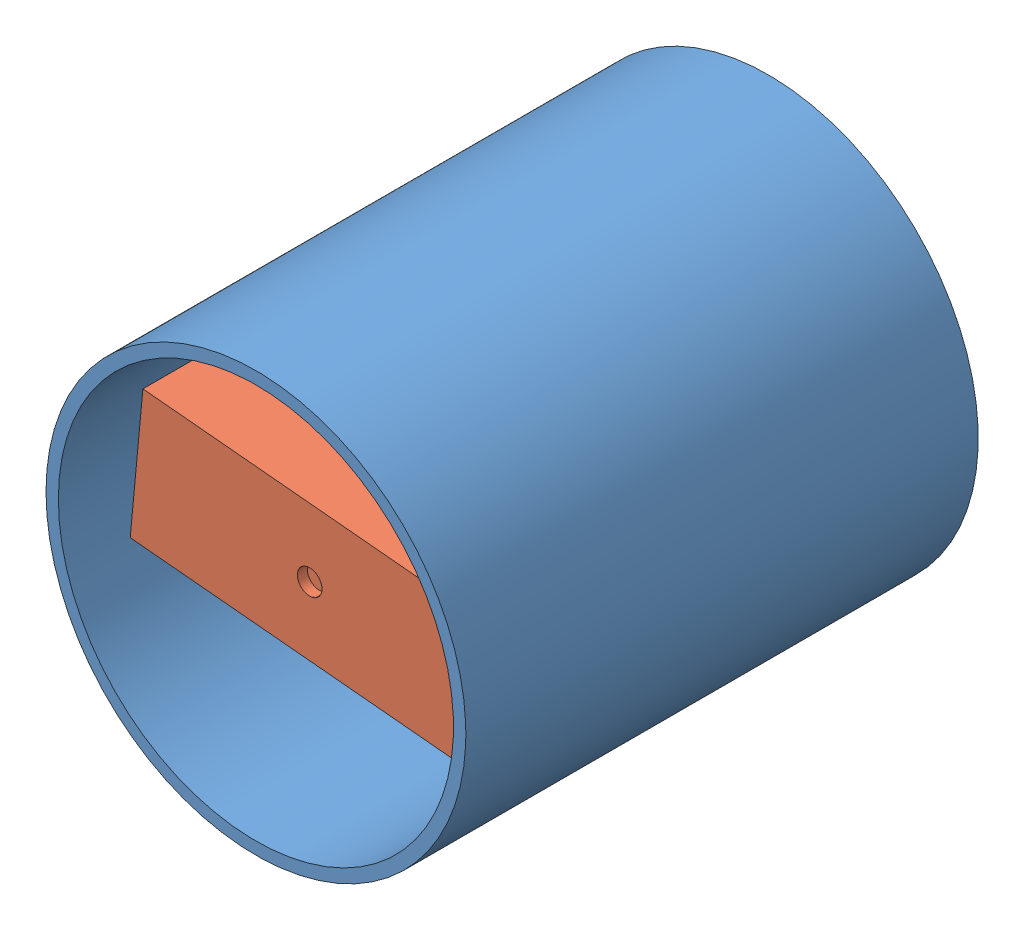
SolidWorks assembly Assem1.sldasm, configuration Default (file format 12000). Lengths in mm.
Overall size (107.95 107.95 131.75).
2 component instances, 2 part files, 1 mates.
Components (placement in the parent):
- Control Case-1: Control Case.SLDPRT [Default] at (75.8165 61.5642 20.43) size (107.95 107.95 131.75)
- Control Module-1: Control Module.SLDPRT [Default] at (77.1963 78.9612 82.0236) x (0 0 1) z (-0.995613 0.093566 0) size (103.17 34.92 88.9)
Mates (geometry in assembly coordinates):
- Concentric1: concentric anti-aligned: cylinder of Control Case-1 through (75.8165 61.5642 147.43) axis (0 0 -1) radius 50.8; cylinder of Control Module-1 through (75.8165 61.5642 131.071) axis (0 0 1) radius 3.175
